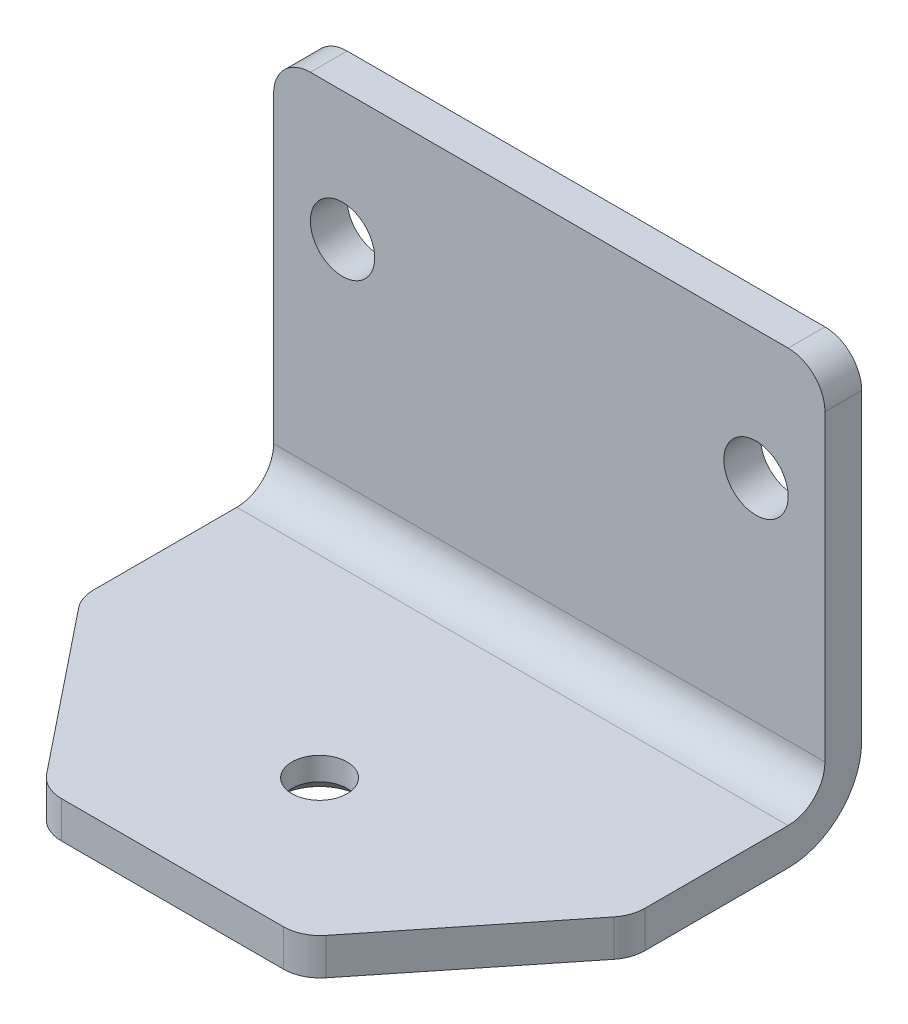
ISO-10303-21;
HEADER;
FILE_DESCRIPTION(('STEP AP214'),'2;1');
FILE_NAME('part.step','',(''),(''),'','','');
FILE_SCHEMA(('AUTOMOTIVE_DESIGN { 1 0 10303 214 1 1 1 1 }'));
ENDSEC;
DATA;
#1=APPLICATION_CONTEXT('core data for automotive mechanical design processes');
#2=APPLICATION_PROTOCOL_DEFINITION('international standard','automotive_design',2000,#1);
#3=PRODUCT_CONTEXT('',#1,'mechanical');
#4=PRODUCT('Part','Part','',(#3));
#5=PRODUCT_RELATED_PRODUCT_CATEGORY('part','',(#4));
#6=PRODUCT_DEFINITION_FORMATION('','',#4);
#7=PRODUCT_DEFINITION_CONTEXT('part definition',#1,'design');
#8=PRODUCT_DEFINITION('design','',#6,#7);
#9=PRODUCT_DEFINITION_SHAPE('','',#8);
#10=(LENGTH_UNIT() NAMED_UNIT(*) SI_UNIT(.MILLI.,.METRE.));
#11=(NAMED_UNIT(*) PLANE_ANGLE_UNIT() SI_UNIT($,.RADIAN.));
#12=(NAMED_UNIT(*) SI_UNIT($,.STERADIAN.) SOLID_ANGLE_UNIT());
#13=UNCERTAINTY_MEASURE_WITH_UNIT(LENGTH_MEASURE(1.E-05),#10,'distance_accuracy_value','');
#14=(GEOMETRIC_REPRESENTATION_CONTEXT(3) GLOBAL_UNCERTAINTY_ASSIGNED_CONTEXT((#13)) GLOBAL_UNIT_ASSIGNED_CONTEXT((#10,
#11,#12)) REPRESENTATION_CONTEXT('',''));
#15=CARTESIAN_POINT('',(0.,0.,0.));
#16=DIRECTION('',(0.,0.,1.));
#17=DIRECTION('',(1.,0.,0.));
#18=AXIS2_PLACEMENT_3D('',#15,#16,#17);
#19=CARTESIAN_POINT('',(30.,0.,0.));
#20=DIRECTION('',(0.,-1.,0.));
#21=DIRECTION('',(0.,0.,-1.));
#22=AXIS2_PLACEMENT_3D('',#19,#20,#21);
#23=PLANE('',#22);
#24=DIRECTION('',(0.,0.,1.));
#25=VECTOR('',#24,1.);
#26=CARTESIAN_POINT('',(30.,0.,0.));
#27=LINE('',#26,#25);
#28=CARTESIAN_POINT('',(30.,0.,7.99999999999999));
#29=VERTEX_POINT('',#28);
#30=CARTESIAN_POINT('',(30.,0.,23.5968757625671));
#31=VERTEX_POINT('',#30);
#32=EDGE_CURVE('E183',#29,#31,#27,.T.);
#33=ORIENTED_EDGE('',*,*,#32,.T.);
#34=CARTESIAN_POINT('',(26.,0.,23.5968757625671));
#35=DIRECTION('',(0.,-1.,0.));
#36=DIRECTION('',(0.,0.,-1.));
#37=AXIS2_PLACEMENT_3D('',#34,#35,#36);
#38=CIRCLE('',#37,4.);
#39=CARTESIAN_POINT('',(29.1234752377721,0.,26.0956559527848));
#40=VERTEX_POINT('',#39);
#41=EDGE_CURVE('E249',#31,#40,#38,.T.);
#42=ORIENTED_EDGE('',*,*,#41,.T.);
#43=DIRECTION('',(0.624695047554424,0.,-0.78086880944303));
#44=VECTOR('',#43,1.);
#45=CARTESIAN_POINT('',(42.1951219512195,0.,9.75609756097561));
#46=LINE('',#45,#44);
#47=CARTESIAN_POINT('',(15.2009758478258,0.,43.4987801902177));
#48=VERTEX_POINT('',#47);
#49=EDGE_CURVE('E234',#40,#48,#46,.F.);
#50=ORIENTED_EDGE('',*,*,#49,.T.);
#51=CARTESIAN_POINT('',(12.0775006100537,0.,41.));
#52=DIRECTION('',(0.,-1.,0.));
#53=DIRECTION('',(0.,0.,-1.));
#54=AXIS2_PLACEMENT_3D('',#51,#52,#53);
#55=CIRCLE('',#54,4.);
#56=CARTESIAN_POINT('',(12.0775006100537,0.,45.));
#57=VERTEX_POINT('',#56);
#58=EDGE_CURVE('E247',#48,#57,#55,.T.);
#59=ORIENTED_EDGE('',*,*,#58,.T.);
#60=DIRECTION('',(-1.,0.,0.));
#61=VECTOR('',#60,1.);
#62=CARTESIAN_POINT('',(30.,0.,45.));
#63=LINE('',#62,#61);
#64=CARTESIAN_POINT('',(-12.0775006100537,0.,45.));
#65=VERTEX_POINT('',#64);
#66=EDGE_CURVE('E196',#57,#65,#63,.T.);
#67=ORIENTED_EDGE('',*,*,#66,.T.);
#68=CARTESIAN_POINT('',(-12.0775006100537,0.,41.));
#69=DIRECTION('',(0.,-1.,0.));
#70=DIRECTION('',(0.,0.,-1.));
#71=AXIS2_PLACEMENT_3D('',#68,#69,#70);
#72=CIRCLE('',#71,4.);
#73=CARTESIAN_POINT('',(-15.2009758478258,0.,43.4987801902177));
#74=VERTEX_POINT('',#73);
#75=EDGE_CURVE('E245',#65,#74,#72,.T.);
#76=ORIENTED_EDGE('',*,*,#75,.T.);
#77=DIRECTION('',(-0.624695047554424,0.,-0.78086880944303));
#78=VECTOR('',#77,1.);
#79=CARTESIAN_POINT('',(-18.7804878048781,0.,39.0243902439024));
#80=LINE('',#79,#78);
#81=CARTESIAN_POINT('',(-29.1234752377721,0.,26.0956559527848));
#82=VERTEX_POINT('',#81);
#83=EDGE_CURVE('E237',#74,#82,#80,.T.);
#84=ORIENTED_EDGE('',*,*,#83,.T.);
#85=CARTESIAN_POINT('',(-26.,0.,23.5968757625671));
#86=DIRECTION('',(0.,-1.,0.));
#87=DIRECTION('',(0.,0.,-1.));
#88=AXIS2_PLACEMENT_3D('',#85,#86,#87);
#89=CIRCLE('',#88,4.);
#90=CARTESIAN_POINT('',(-30.,0.,23.5968757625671));
#91=VERTEX_POINT('',#90);
#92=EDGE_CURVE('E243',#82,#91,#89,.T.);
#93=ORIENTED_EDGE('',*,*,#92,.T.);
#94=DIRECTION('',(0.,0.,1.));
#95=VECTOR('',#94,1.);
#96=CARTESIAN_POINT('',(-30.,0.,0.));
#97=LINE('',#96,#95);
#98=CARTESIAN_POINT('',(-30.,0.,7.99999999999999));
#99=VERTEX_POINT('',#98);
#100=EDGE_CURVE('E169',#99,#91,#97,.T.);
#101=ORIENTED_EDGE('',*,*,#100,.F.);
#102=DIRECTION('',(-1.,0.,0.));
#103=VECTOR('',#102,1.);
#104=CARTESIAN_POINT('',(30.,0.,8.));
#105=LINE('',#104,#103);
#106=EDGE_CURVE('E207',#99,#29,#105,.F.);
#107=ORIENTED_EDGE('',*,*,#106,.T.);
#108=EDGE_LOOP('',(#33,#42,#50,#59,#67,#76,#84,#93,#101,#107));
#109=FACE_BOUND('',#108,.T.);
#110=CARTESIAN_POINT('',(0.,0.,29.));
#111=DIRECTION('',(0.,-1.,0.));
#112=DIRECTION('',(0.,0.,-1.));
#113=AXIS2_PLACEMENT_3D('',#110,#111,#112);
#114=CIRCLE('',#113,4.5);
#115=CARTESIAN_POINT('',(0.,0.,24.5));
#116=VERTEX_POINT('',#115);
#117=EDGE_CURVE('E366',#116,#116,#114,.T.);
#118=ORIENTED_EDGE('',*,*,#117,.F.);
#119=EDGE_LOOP('',(#118));
#120=FACE_BOUND('',#119,.T.);
#121=ADVANCED_FACE('F29',(#109,#120),#23,.T.);
#122=CARTESIAN_POINT('',(0.,0.,29.));
#123=DIRECTION('',(0.,1.,0.));
#124=DIRECTION('',(0.,0.,1.));
#125=AXIS2_PLACEMENT_3D('',#122,#123,#124);
#126=CYLINDRICAL_SURFACE('',#125,3.);
#127=CARTESIAN_POINT('',(0.,4.,29.));
#128=DIRECTION('',(0.,1.,0.));
#129=DIRECTION('',(0.,0.,1.));
#130=AXIS2_PLACEMENT_3D('',#127,#128,#129);
#131=CIRCLE('',#130,3.);
#132=CARTESIAN_POINT('',(0.,4.,32.));
#133=VERTEX_POINT('',#132);
#134=EDGE_CURVE('E358',#133,#133,#131,.T.);
#135=ORIENTED_EDGE('',*,*,#134,.T.);
#136=EDGE_LOOP('',(#135));
#137=FACE_BOUND('',#136,.T.);
#138=CARTESIAN_POINT('',(0.,1.49999999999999,29.));
#139=DIRECTION('',(0.,-1.,0.));
#140=DIRECTION('',(0.,0.,-1.));
#141=AXIS2_PLACEMENT_3D('',#138,#139,#140);
#142=CIRCLE('',#141,3.);
#143=CARTESIAN_POINT('',(0.,1.49999999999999,26.));
#144=VERTEX_POINT('',#143);
#145=EDGE_CURVE('E360',#144,#144,#142,.T.);
#146=ORIENTED_EDGE('',*,*,#145,.T.);
#147=EDGE_LOOP('',(#146));
#148=FACE_BOUND('',#147,.T.);
#149=ADVANCED_FACE('F338',(#137,#148),#126,.F.);
#150=CARTESIAN_POINT('',(30.,4.,0.));
#151=DIRECTION('',(0.,-1.,0.));
#152=DIRECTION('',(0.,0.,-1.));
#153=AXIS2_PLACEMENT_3D('',#150,#151,#152);
#154=PLANE('',#153);
#155=ORIENTED_EDGE('',*,*,#134,.F.);
#156=EDGE_LOOP('',(#155));
#157=FACE_BOUND('',#156,.T.);
#158=DIRECTION('',(-0.624695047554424,0.,0.78086880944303));
#159=VECTOR('',#158,1.);
#160=CARTESIAN_POINT('',(14.,3.99999999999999,45.));
#161=LINE('',#160,#159);
#162=CARTESIAN_POINT('',(15.2009758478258,3.99999999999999,43.4987801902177));
#163=VERTEX_POINT('',#162);
#164=CARTESIAN_POINT('',(29.1234752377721,4.,26.0956559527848));
#165=VERTEX_POINT('',#164);
#166=EDGE_CURVE('E230',#163,#165,#161,.F.);
#167=ORIENTED_EDGE('',*,*,#166,.T.);
#168=CARTESIAN_POINT('',(26.,4.,23.5968757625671));
#169=DIRECTION('',(0.,-1.,0.));
#170=DIRECTION('',(0.,0.,-1.));
#171=AXIS2_PLACEMENT_3D('',#168,#169,#170);
#172=CIRCLE('',#171,4.);
#173=CARTESIAN_POINT('',(30.,4.,23.5968757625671));
#174=VERTEX_POINT('',#173);
#175=EDGE_CURVE('E259',#165,#174,#172,.F.);
#176=ORIENTED_EDGE('',*,*,#175,.T.);
#177=DIRECTION('',(0.,0.,1.));
#178=VECTOR('',#177,1.);
#179=CARTESIAN_POINT('',(30.,4.,0.));
#180=LINE('',#179,#178);
#181=CARTESIAN_POINT('',(30.,4.,8.));
#182=VERTEX_POINT('',#181);
#183=EDGE_CURVE('E163',#182,#174,#180,.T.);
#184=ORIENTED_EDGE('',*,*,#183,.F.);
#185=DIRECTION('',(-1.,0.,0.));
#186=VECTOR('',#185,1.);
#187=CARTESIAN_POINT('',(-30.,4.,8.));
#188=LINE('',#187,#186);
#189=CARTESIAN_POINT('',(-30.,4.,8.));
#190=VERTEX_POINT('',#189);
#191=EDGE_CURVE('E150',#182,#190,#188,.T.);
#192=ORIENTED_EDGE('',*,*,#191,.T.);
#193=DIRECTION('',(0.,0.,1.));
#194=VECTOR('',#193,1.);
#195=CARTESIAN_POINT('',(-30.,4.,0.));
#196=LINE('',#195,#194);
#197=CARTESIAN_POINT('',(-30.,4.,23.5968757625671));
#198=VERTEX_POINT('',#197);
#199=EDGE_CURVE('E161',#190,#198,#196,.T.);
#200=ORIENTED_EDGE('',*,*,#199,.T.);
#201=CARTESIAN_POINT('',(-26.,4.,23.5968757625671));
#202=DIRECTION('',(0.,-1.,0.));
#203=DIRECTION('',(0.,0.,-1.));
#204=AXIS2_PLACEMENT_3D('',#201,#202,#203);
#205=CIRCLE('',#204,4.);
#206=CARTESIAN_POINT('',(-29.1234752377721,4.,26.0956559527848));
#207=VERTEX_POINT('',#206);
#208=EDGE_CURVE('E255',#198,#207,#205,.F.);
#209=ORIENTED_EDGE('',*,*,#208,.T.);
#210=DIRECTION('',(0.624695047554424,0.,0.78086880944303));
#211=VECTOR('',#210,1.);
#212=CARTESIAN_POINT('',(-30.,4.,25.));
#213=LINE('',#212,#211);
#214=CARTESIAN_POINT('',(-15.2009758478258,3.99999999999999,43.4987801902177));
#215=VERTEX_POINT('',#214);
#216=EDGE_CURVE('E232',#207,#215,#213,.T.);
#217=ORIENTED_EDGE('',*,*,#216,.T.);
#218=CARTESIAN_POINT('',(-12.0775006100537,3.99999999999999,41.));
#219=DIRECTION('',(0.,-1.,0.));
#220=DIRECTION('',(0.,0.,-1.));
#221=AXIS2_PLACEMENT_3D('',#218,#219,#220);
#222=CIRCLE('',#221,4.);
#223=CARTESIAN_POINT('',(-12.0775006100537,3.99999999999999,45.));
#224=VERTEX_POINT('',#223);
#225=EDGE_CURVE('E44',#215,#224,#222,.F.);
#226=ORIENTED_EDGE('',*,*,#225,.T.);
#227=DIRECTION('',(-1.,0.,0.));
#228=VECTOR('',#227,1.);
#229=CARTESIAN_POINT('',(30.,3.99999999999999,45.));
#230=LINE('',#229,#228);
#231=CARTESIAN_POINT('',(12.0775006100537,3.99999999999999,45.));
#232=VERTEX_POINT('',#231);
#233=EDGE_CURVE('E164',#232,#224,#230,.T.);
#234=ORIENTED_EDGE('',*,*,#233,.F.);
#235=CARTESIAN_POINT('',(12.0775006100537,3.99999999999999,41.));
#236=DIRECTION('',(0.,-1.,0.));
#237=DIRECTION('',(0.,0.,-1.));
#238=AXIS2_PLACEMENT_3D('',#235,#236,#237);
#239=CIRCLE('',#238,4.);
#240=EDGE_CURVE('E52',#232,#163,#239,.F.);
#241=ORIENTED_EDGE('',*,*,#240,.T.);
#242=EDGE_LOOP('',(#167,#176,#184,#192,#200,#209,#217,#226,#234,#241));
#243=FACE_BOUND('',#242,.T.);
#244=ADVANCED_FACE('F31',(#157,#243),#154,.F.);
#245=CARTESIAN_POINT('',(30.,0.,45.));
#246=DIRECTION('',(0.,0.,1.));
#247=DIRECTION('',(1.,0.,0.));
#248=AXIS2_PLACEMENT_3D('',#245,#246,#247);
#249=PLANE('',#248);
#250=ORIENTED_EDGE('',*,*,#66,.F.);
#251=DIRECTION('',(0.,-1.,0.));
#252=VECTOR('',#251,1.);
#253=CARTESIAN_POINT('',(12.0775006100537,0.,45.));
#254=LINE('',#253,#252);
#255=EDGE_CURVE('E264',#57,#232,#254,.F.);
#256=ORIENTED_EDGE('',*,*,#255,.T.);
#257=ORIENTED_EDGE('',*,*,#233,.T.);
#258=DIRECTION('',(0.,-1.,0.));
#259=VECTOR('',#258,1.);
#260=CARTESIAN_POINT('',(-12.0775006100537,0.,45.));
#261=LINE('',#260,#259);
#262=EDGE_CURVE('E261',#224,#65,#261,.T.);
#263=ORIENTED_EDGE('',*,*,#262,.T.);
#264=EDGE_LOOP('',(#250,#256,#257,#263));
#265=FACE_BOUND('',#264,.T.);
#266=ADVANCED_FACE('F278',(#265),#249,.T.);
#267=CARTESIAN_POINT('',(30.,0.,0.));
#268=DIRECTION('',(0.,0.,-1.));
#269=DIRECTION('',(-1.,0.,0.));
#270=AXIS2_PLACEMENT_3D('',#267,#268,#269);
#271=PLANE('',#270);
#272=CARTESIAN_POINT('',(22.5,31.,0.));
#273=DIRECTION('',(0.,0.,1.));
#274=DIRECTION('',(1.,0.,0.));
#275=AXIS2_PLACEMENT_3D('',#272,#273,#274);
#276=CIRCLE('',#275,3.5);
#277=CARTESIAN_POINT('',(26.,31.,0.));
#278=VERTEX_POINT('',#277);
#279=EDGE_CURVE('E359',#278,#278,#276,.T.);
#280=ORIENTED_EDGE('',*,*,#279,.T.);
#281=EDGE_LOOP('',(#280));
#282=FACE_BOUND('',#281,.T.);
#283=CARTESIAN_POINT('',(-22.5,31.,0.));
#284=DIRECTION('',(0.,0.,1.));
#285=DIRECTION('',(1.,0.,0.));
#286=AXIS2_PLACEMENT_3D('',#283,#284,#285);
#287=CIRCLE('',#286,3.5);
#288=CARTESIAN_POINT('',(-19.,31.,0.));
#289=VERTEX_POINT('',#288);
#290=EDGE_CURVE('E170',#289,#289,#287,.T.);
#291=ORIENTED_EDGE('',*,*,#290,.T.);
#292=EDGE_LOOP('',(#291));
#293=FACE_BOUND('',#292,.T.);
#294=DIRECTION('',(-1.,0.,0.));
#295=VECTOR('',#294,1.);
#296=CARTESIAN_POINT('',(30.,45.,0.));
#297=LINE('',#296,#295);
#298=CARTESIAN_POINT('',(26.,45.,0.));
#299=VERTEX_POINT('',#298);
#300=CARTESIAN_POINT('',(-26.,45.,0.));
#301=VERTEX_POINT('',#300);
#302=EDGE_CURVE('E193',#299,#301,#297,.T.);
#303=ORIENTED_EDGE('',*,*,#302,.F.);
#304=CARTESIAN_POINT('',(26.,41.,0.));
#305=DIRECTION('',(0.,0.,-1.));
#306=DIRECTION('',(-1.,0.,0.));
#307=AXIS2_PLACEMENT_3D('',#304,#305,#306);
#308=CIRCLE('',#307,4.);
#309=CARTESIAN_POINT('',(30.,41.,0.));
#310=VERTEX_POINT('',#309);
#311=EDGE_CURVE('E219',#299,#310,#308,.T.);
#312=ORIENTED_EDGE('',*,*,#311,.T.);
#313=DIRECTION('',(0.,-1.,0.));
#314=VECTOR('',#313,1.);
#315=CARTESIAN_POINT('',(30.,0.,0.));
#316=LINE('',#315,#314);
#317=CARTESIAN_POINT('',(30.,7.99999999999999,0.));
#318=VERTEX_POINT('',#317);
#319=EDGE_CURVE('E186',#310,#318,#316,.T.);
#320=ORIENTED_EDGE('',*,*,#319,.T.);
#321=DIRECTION('',(-1.,0.,0.));
#322=VECTOR('',#321,1.);
#323=CARTESIAN_POINT('',(30.,7.99999999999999,0.));
#324=LINE('',#323,#322);
#325=CARTESIAN_POINT('',(-30.,7.99999999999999,0.));
#326=VERTEX_POINT('',#325);
#327=EDGE_CURVE('E202',#318,#326,#324,.T.);
#328=ORIENTED_EDGE('',*,*,#327,.T.);
#329=DIRECTION('',(0.,-1.,0.));
#330=VECTOR('',#329,1.);
#331=CARTESIAN_POINT('',(-30.,0.,0.));
#332=LINE('',#331,#330);
#333=CARTESIAN_POINT('',(-30.,41.,0.));
#334=VERTEX_POINT('',#333);
#335=EDGE_CURVE('E172',#334,#326,#332,.T.);
#336=ORIENTED_EDGE('',*,*,#335,.F.);
#337=CARTESIAN_POINT('',(-26.,41.,0.));
#338=DIRECTION('',(0.,0.,-1.));
#339=DIRECTION('',(-1.,0.,0.));
#340=AXIS2_PLACEMENT_3D('',#337,#338,#339);
#341=CIRCLE('',#340,4.);
#342=EDGE_CURVE('E217',#334,#301,#341,.T.);
#343=ORIENTED_EDGE('',*,*,#342,.T.);
#344=EDGE_LOOP('',(#303,#312,#320,#328,#336,#343));
#345=FACE_BOUND('',#344,.T.);
#346=ADVANCED_FACE('F309',(#282,#293,#345),#271,.T.);
#347=CARTESIAN_POINT('',(30.,45.,4.));
#348=DIRECTION('',(0.,1.,0.));
#349=DIRECTION('',(0.,0.,1.));
#350=AXIS2_PLACEMENT_3D('',#347,#348,#349);
#351=PLANE('',#350);
#352=DIRECTION('',(-1.,0.,0.));
#353=VECTOR('',#352,1.);
#354=CARTESIAN_POINT('',(30.,45.,4.));
#355=LINE('',#354,#353);
#356=CARTESIAN_POINT('',(26.,45.,4.));
#357=VERTEX_POINT('',#356);
#358=CARTESIAN_POINT('',(-26.,45.,4.));
#359=VERTEX_POINT('',#358);
#360=EDGE_CURVE('E190',#357,#359,#355,.T.);
#361=ORIENTED_EDGE('',*,*,#360,.F.);
#362=DIRECTION('',(0.,0.,-1.));
#363=VECTOR('',#362,1.);
#364=CARTESIAN_POINT('',(26.,45.,4.));
#365=LINE('',#364,#363);
#366=EDGE_CURVE('E214',#357,#299,#365,.T.);
#367=ORIENTED_EDGE('',*,*,#366,.T.);
#368=ORIENTED_EDGE('',*,*,#302,.T.);
#369=DIRECTION('',(0.,0.,-1.));
#370=VECTOR('',#369,1.);
#371=CARTESIAN_POINT('',(-26.,45.,4.));
#372=LINE('',#371,#370);
#373=EDGE_CURVE('E212',#301,#359,#372,.F.);
#374=ORIENTED_EDGE('',*,*,#373,.T.);
#375=EDGE_LOOP('',(#361,#367,#368,#374));
#376=FACE_BOUND('',#375,.T.);
#377=ADVANCED_FACE('F312',(#376),#351,.T.);
#378=CARTESIAN_POINT('',(30.,0.,4.));
#379=DIRECTION('',(0.,0.,-1.));
#380=DIRECTION('',(-1.,0.,0.));
#381=AXIS2_PLACEMENT_3D('',#378,#379,#380);
#382=PLANE('',#381);
#383=CARTESIAN_POINT('',(22.5,31.,4.));
#384=DIRECTION('',(0.,0.,1.));
#385=DIRECTION('',(1.,0.,0.));
#386=AXIS2_PLACEMENT_3D('',#383,#384,#385);
#387=CIRCLE('',#386,3.5);
#388=CARTESIAN_POINT('',(26.,31.,4.));
#389=VERTEX_POINT('',#388);
#390=EDGE_CURVE('E363',#389,#389,#387,.T.);
#391=ORIENTED_EDGE('',*,*,#390,.F.);
#392=EDGE_LOOP('',(#391));
#393=FACE_BOUND('',#392,.T.);
#394=CARTESIAN_POINT('',(-22.5,31.,4.));
#395=DIRECTION('',(0.,0.,1.));
#396=DIRECTION('',(1.,0.,0.));
#397=AXIS2_PLACEMENT_3D('',#394,#395,#396);
#398=CIRCLE('',#397,3.5);
#399=CARTESIAN_POINT('',(-19.,31.,4.));
#400=VERTEX_POINT('',#399);
#401=EDGE_CURVE('E175',#400,#400,#398,.T.);
#402=ORIENTED_EDGE('',*,*,#401,.F.);
#403=EDGE_LOOP('',(#402));
#404=FACE_BOUND('',#403,.T.);
#405=DIRECTION('',(0.,1.,0.));
#406=VECTOR('',#405,1.);
#407=CARTESIAN_POINT('',(30.,0.,4.));
#408=LINE('',#407,#406);
#409=CARTESIAN_POINT('',(30.,41.,4.));
#410=VERTEX_POINT('',#409);
#411=CARTESIAN_POINT('',(30.,8.,4.));
#412=VERTEX_POINT('',#411);
#413=EDGE_CURVE('E188',#410,#412,#408,.F.);
#414=ORIENTED_EDGE('',*,*,#413,.F.);
#415=CARTESIAN_POINT('',(26.,41.,4.));
#416=DIRECTION('',(0.,0.,-1.));
#417=DIRECTION('',(-1.,0.,0.));
#418=AXIS2_PLACEMENT_3D('',#415,#416,#417);
#419=CIRCLE('',#418,4.);
#420=EDGE_CURVE('E225',#410,#357,#419,.F.);
#421=ORIENTED_EDGE('',*,*,#420,.T.);
#422=ORIENTED_EDGE('',*,*,#360,.T.);
#423=CARTESIAN_POINT('',(-26.,41.,4.));
#424=DIRECTION('',(0.,0.,-1.));
#425=DIRECTION('',(-1.,0.,0.));
#426=AXIS2_PLACEMENT_3D('',#423,#424,#425);
#427=CIRCLE('',#426,4.);
#428=CARTESIAN_POINT('',(-30.,41.,4.));
#429=VERTEX_POINT('',#428);
#430=EDGE_CURVE('E223',#359,#429,#427,.F.);
#431=ORIENTED_EDGE('',*,*,#430,.T.);
#432=DIRECTION('',(0.,1.,0.));
#433=VECTOR('',#432,1.);
#434=CARTESIAN_POINT('',(-30.,0.,4.));
#435=LINE('',#434,#433);
#436=CARTESIAN_POINT('',(-30.,8.,4.));
#437=VERTEX_POINT('',#436);
#438=EDGE_CURVE('E180',#429,#437,#435,.F.);
#439=ORIENTED_EDGE('',*,*,#438,.T.);
#440=DIRECTION('',(-1.,0.,0.));
#441=VECTOR('',#440,1.);
#442=CARTESIAN_POINT('',(30.,8.,4.));
#443=LINE('',#442,#441);
#444=EDGE_CURVE('E152',#437,#412,#443,.F.);
#445=ORIENTED_EDGE('',*,*,#444,.T.);
#446=EDGE_LOOP('',(#414,#421,#422,#431,#439,#445));
#447=FACE_BOUND('',#446,.T.);
#448=ADVANCED_FACE('F300',(#393,#404,#447),#382,.F.);
#449=CARTESIAN_POINT('',(30.,4.,0.));
#450=DIRECTION('',(1.,0.,0.));
#451=DIRECTION('',(0.,0.,-1.));
#452=AXIS2_PLACEMENT_3D('',#449,#450,#451);
#453=PLANE('',#452);
#454=ORIENTED_EDGE('',*,*,#183,.T.);
#455=DIRECTION('',(0.,1.,0.));
#456=VECTOR('',#455,1.);
#457=CARTESIAN_POINT('',(30.,4.,23.5968757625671));
#458=LINE('',#457,#456);
#459=EDGE_CURVE('E240',#174,#31,#458,.F.);
#460=ORIENTED_EDGE('',*,*,#459,.T.);
#461=ORIENTED_EDGE('',*,*,#32,.F.);
#462=CARTESIAN_POINT('',(30.,7.99999999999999,8.));
#463=DIRECTION('',(1.,0.,0.));
#464=DIRECTION('',(0.,0.,-1.));
#465=AXIS2_PLACEMENT_3D('',#462,#463,#464);
#466=CIRCLE('',#465,8.);
#467=EDGE_CURVE('E209',#29,#318,#466,.T.);
#468=ORIENTED_EDGE('',*,*,#467,.T.);
#469=ORIENTED_EDGE('',*,*,#319,.F.);
#470=DIRECTION('',(0.,0.,-1.));
#471=VECTOR('',#470,1.);
#472=CARTESIAN_POINT('',(30.,41.,0.));
#473=LINE('',#472,#471);
#474=EDGE_CURVE('E221',#310,#410,#473,.F.);
#475=ORIENTED_EDGE('',*,*,#474,.T.);
#476=ORIENTED_EDGE('',*,*,#413,.T.);
#477=CARTESIAN_POINT('',(30.,8.,8.));
#478=DIRECTION('',(1.,0.,0.));
#479=DIRECTION('',(0.,0.,-1.));
#480=AXIS2_PLACEMENT_3D('',#477,#478,#479);
#481=CIRCLE('',#480,4.);
#482=EDGE_CURVE('E156',#412,#182,#481,.F.);
#483=ORIENTED_EDGE('',*,*,#482,.T.);
#484=EDGE_LOOP('',(#454,#460,#461,#468,#469,#475,#476,#483));
#485=FACE_BOUND('',#484,.T.);
#486=ADVANCED_FACE('F293',(#485),#453,.T.);
#487=CARTESIAN_POINT('',(-30.,4.,0.));
#488=DIRECTION('',(1.,0.,0.));
#489=DIRECTION('',(0.,0.,-1.));
#490=AXIS2_PLACEMENT_3D('',#487,#488,#489);
#491=PLANE('',#490);
#492=ORIENTED_EDGE('',*,*,#100,.T.);
#493=DIRECTION('',(0.,1.,0.));
#494=VECTOR('',#493,1.);
#495=CARTESIAN_POINT('',(-30.,4.,23.5968757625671));
#496=LINE('',#495,#494);
#497=EDGE_CURVE('E11',#91,#198,#496,.T.);
#498=ORIENTED_EDGE('',*,*,#497,.T.);
#499=ORIENTED_EDGE('',*,*,#199,.F.);
#500=CARTESIAN_POINT('',(-30.,8.,8.));
#501=DIRECTION('',(1.,0.,0.));
#502=DIRECTION('',(0.,0.,-1.));
#503=AXIS2_PLACEMENT_3D('',#500,#501,#502);
#504=CIRCLE('',#503,4.);
#505=EDGE_CURVE('E146',#190,#437,#504,.T.);
#506=ORIENTED_EDGE('',*,*,#505,.T.);
#507=ORIENTED_EDGE('',*,*,#438,.F.);
#508=DIRECTION('',(0.,0.,-1.));
#509=VECTOR('',#508,1.);
#510=CARTESIAN_POINT('',(-30.,41.,0.));
#511=LINE('',#510,#509);
#512=EDGE_CURVE('E227',#429,#334,#511,.T.);
#513=ORIENTED_EDGE('',*,*,#512,.T.);
#514=ORIENTED_EDGE('',*,*,#335,.T.);
#515=CARTESIAN_POINT('',(-30.,7.99999999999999,8.));
#516=DIRECTION('',(1.,0.,0.));
#517=DIRECTION('',(0.,0.,-1.));
#518=AXIS2_PLACEMENT_3D('',#515,#516,#517);
#519=CIRCLE('',#518,8.);
#520=EDGE_CURVE('E205',#326,#99,#519,.F.);
#521=ORIENTED_EDGE('',*,*,#520,.T.);
#522=EDGE_LOOP('',(#492,#498,#499,#506,#507,#513,#514,#521));
#523=FACE_BOUND('',#522,.T.);
#524=ADVANCED_FACE('F167',(#523),#491,.F.);
#525=CARTESIAN_POINT('',(30.,8.,8.));
#526=DIRECTION('',(1.,0.,0.));
#527=DIRECTION('',(0.,0.,-1.));
#528=AXIS2_PLACEMENT_3D('',#525,#526,#527);
#529=CYLINDRICAL_SURFACE('',#528,4.);
#530=ORIENTED_EDGE('',*,*,#482,.F.);
#531=ORIENTED_EDGE('',*,*,#444,.F.);
#532=ORIENTED_EDGE('',*,*,#505,.F.);
#533=ORIENTED_EDGE('',*,*,#191,.F.);
#534=EDGE_LOOP('',(#530,#531,#532,#533));
#535=FACE_BOUND('',#534,.T.);
#536=ADVANCED_FACE('F149',(#535),#529,.F.);
#537=CARTESIAN_POINT('',(30.,7.99999999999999,8.));
#538=DIRECTION('',(-1.,0.,0.));
#539=DIRECTION('',(0.,0.,1.));
#540=AXIS2_PLACEMENT_3D('',#537,#538,#539);
#541=CYLINDRICAL_SURFACE('',#540,8.);
#542=ORIENTED_EDGE('',*,*,#467,.F.);
#543=ORIENTED_EDGE('',*,*,#106,.F.);
#544=ORIENTED_EDGE('',*,*,#520,.F.);
#545=ORIENTED_EDGE('',*,*,#327,.F.);
#546=EDGE_LOOP('',(#542,#543,#544,#545));
#547=FACE_BOUND('',#546,.T.);
#548=ADVANCED_FACE('F321',(#547),#541,.T.);
#549=CARTESIAN_POINT('',(26.,41.,4.));
#550=DIRECTION('',(0.,0.,-1.));
#551=DIRECTION('',(-1.,0.,0.));
#552=AXIS2_PLACEMENT_3D('',#549,#550,#551);
#553=CYLINDRICAL_SURFACE('',#552,4.);
#554=ORIENTED_EDGE('',*,*,#420,.F.);
#555=ORIENTED_EDGE('',*,*,#474,.F.);
#556=ORIENTED_EDGE('',*,*,#311,.F.);
#557=ORIENTED_EDGE('',*,*,#366,.F.);
#558=EDGE_LOOP('',(#554,#555,#556,#557));
#559=FACE_BOUND('',#558,.T.);
#560=ADVANCED_FACE('F315',(#559),#553,.T.);
#561=CARTESIAN_POINT('',(-26.,41.,0.));
#562=DIRECTION('',(0.,0.,1.));
#563=DIRECTION('',(1.,0.,0.));
#564=AXIS2_PLACEMENT_3D('',#561,#562,#563);
#565=CYLINDRICAL_SURFACE('',#564,4.);
#566=ORIENTED_EDGE('',*,*,#430,.F.);
#567=ORIENTED_EDGE('',*,*,#373,.F.);
#568=ORIENTED_EDGE('',*,*,#342,.F.);
#569=ORIENTED_EDGE('',*,*,#512,.F.);
#570=EDGE_LOOP('',(#566,#567,#568,#569));
#571=FACE_BOUND('',#570,.T.);
#572=ADVANCED_FACE('F305',(#571),#565,.T.);
#573=CARTESIAN_POINT('',(-30.,4.,25.));
#574=DIRECTION('',(-0.78086880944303,0.,0.624695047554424));
#575=DIRECTION('',(0.624695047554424,0.,0.78086880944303));
#576=AXIS2_PLACEMENT_3D('',#573,#574,#575);
#577=PLANE('',#576);
#578=ORIENTED_EDGE('',*,*,#83,.F.);
#579=DIRECTION('',(0.,-1.,0.));
#580=VECTOR('',#579,1.);
#581=CARTESIAN_POINT('',(-15.2009758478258,4.,43.4987801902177));
#582=LINE('',#581,#580);
#583=EDGE_CURVE('E37',#74,#215,#582,.F.);
#584=ORIENTED_EDGE('',*,*,#583,.T.);
#585=ORIENTED_EDGE('',*,*,#216,.F.);
#586=DIRECTION('',(0.,1.,0.));
#587=VECTOR('',#586,1.);
#588=CARTESIAN_POINT('',(-29.1234752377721,0.,26.0956559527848));
#589=LINE('',#588,#587);
#590=EDGE_CURVE('E266',#207,#82,#589,.F.);
#591=ORIENTED_EDGE('',*,*,#590,.T.);
#592=EDGE_LOOP('',(#578,#584,#585,#591));
#593=FACE_BOUND('',#592,.T.);
#594=ADVANCED_FACE('F271',(#593),#577,.T.);
#595=CARTESIAN_POINT('',(14.,0.,45.));
#596=DIRECTION('',(-0.78086880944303,0.,-0.624695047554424));
#597=DIRECTION('',(-0.624695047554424,0.,0.78086880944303));
#598=AXIS2_PLACEMENT_3D('',#595,#596,#597);
#599=PLANE('',#598);
#600=ORIENTED_EDGE('',*,*,#49,.F.);
#601=DIRECTION('',(0.,-1.,0.));
#602=VECTOR('',#601,1.);
#603=CARTESIAN_POINT('',(29.1234752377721,0.,26.0956559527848));
#604=LINE('',#603,#602);
#605=EDGE_CURVE('E253',#40,#165,#604,.F.);
#606=ORIENTED_EDGE('',*,*,#605,.T.);
#607=ORIENTED_EDGE('',*,*,#166,.F.);
#608=DIRECTION('',(0.,1.,0.));
#609=VECTOR('',#608,1.);
#610=CARTESIAN_POINT('',(15.2009758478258,0.,43.4987801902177));
#611=LINE('',#610,#609);
#612=EDGE_CURVE('E251',#163,#48,#611,.F.);
#613=ORIENTED_EDGE('',*,*,#612,.T.);
#614=EDGE_LOOP('',(#600,#606,#607,#613));
#615=FACE_BOUND('',#614,.T.);
#616=ADVANCED_FACE('F287',(#615),#599,.F.);
#617=CARTESIAN_POINT('',(26.,4.,23.5968757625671));
#618=DIRECTION('',(0.,1.,0.));
#619=DIRECTION('',(0.,0.,1.));
#620=AXIS2_PLACEMENT_3D('',#617,#618,#619);
#621=CYLINDRICAL_SURFACE('',#620,4.);
#622=ORIENTED_EDGE('',*,*,#175,.F.);
#623=ORIENTED_EDGE('',*,*,#605,.F.);
#624=ORIENTED_EDGE('',*,*,#41,.F.);
#625=ORIENTED_EDGE('',*,*,#459,.F.);
#626=EDGE_LOOP('',(#622,#623,#624,#625));
#627=FACE_BOUND('',#626,.T.);
#628=ADVANCED_FACE('F290',(#627),#621,.T.);
#629=CARTESIAN_POINT('',(12.0775006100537,0.,41.));
#630=DIRECTION('',(0.,-1.,0.));
#631=DIRECTION('',(0.,0.,-1.));
#632=AXIS2_PLACEMENT_3D('',#629,#630,#631);
#633=CYLINDRICAL_SURFACE('',#632,4.);
#634=ORIENTED_EDGE('',*,*,#58,.F.);
#635=ORIENTED_EDGE('',*,*,#612,.F.);
#636=ORIENTED_EDGE('',*,*,#240,.F.);
#637=ORIENTED_EDGE('',*,*,#255,.F.);
#638=EDGE_LOOP('',(#634,#635,#636,#637));
#639=FACE_BOUND('',#638,.T.);
#640=ADVANCED_FACE('F283',(#639),#633,.T.);
#641=CARTESIAN_POINT('',(-12.0775006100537,0.,41.));
#642=DIRECTION('',(0.,-1.,0.));
#643=DIRECTION('',(0.,0.,-1.));
#644=AXIS2_PLACEMENT_3D('',#641,#642,#643);
#645=CYLINDRICAL_SURFACE('',#644,4.);
#646=ORIENTED_EDGE('',*,*,#225,.F.);
#647=ORIENTED_EDGE('',*,*,#583,.F.);
#648=ORIENTED_EDGE('',*,*,#75,.F.);
#649=ORIENTED_EDGE('',*,*,#262,.F.);
#650=EDGE_LOOP('',(#646,#647,#648,#649));
#651=FACE_BOUND('',#650,.T.);
#652=ADVANCED_FACE('F275',(#651),#645,.T.);
#653=CARTESIAN_POINT('',(-26.,4.,23.5968757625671));
#654=DIRECTION('',(0.,-1.,0.));
#655=DIRECTION('',(0.,0.,-1.));
#656=AXIS2_PLACEMENT_3D('',#653,#654,#655);
#657=CYLINDRICAL_SURFACE('',#656,4.);
#658=ORIENTED_EDGE('',*,*,#92,.F.);
#659=ORIENTED_EDGE('',*,*,#590,.F.);
#660=ORIENTED_EDGE('',*,*,#208,.F.);
#661=ORIENTED_EDGE('',*,*,#497,.F.);
#662=EDGE_LOOP('',(#658,#659,#660,#661));
#663=FACE_BOUND('',#662,.T.);
#664=ADVANCED_FACE('F325',(#663),#657,.T.);
#665=CARTESIAN_POINT('',(-22.5,31.,0.));
#666=DIRECTION('',(0.,0.,1.));
#667=DIRECTION('',(1.,0.,0.));
#668=AXIS2_PLACEMENT_3D('',#665,#666,#667);
#669=CYLINDRICAL_SURFACE('',#668,3.5);
#670=ORIENTED_EDGE('',*,*,#290,.F.);
#671=EDGE_LOOP('',(#670));
#672=FACE_BOUND('',#671,.T.);
#673=ORIENTED_EDGE('',*,*,#401,.T.);
#674=EDGE_LOOP('',(#673));
#675=FACE_BOUND('',#674,.T.);
#676=ADVANCED_FACE('F327',(#672,#675),#669,.F.);
#677=CARTESIAN_POINT('',(22.5,31.,0.));
#678=DIRECTION('',(0.,0.,1.));
#679=DIRECTION('',(1.,0.,0.));
#680=AXIS2_PLACEMENT_3D('',#677,#678,#679);
#681=CYLINDRICAL_SURFACE('',#680,3.5);
#682=ORIENTED_EDGE('',*,*,#279,.F.);
#683=EDGE_LOOP('',(#682));
#684=FACE_BOUND('',#683,.T.);
#685=ORIENTED_EDGE('',*,*,#390,.T.);
#686=EDGE_LOOP('',(#685));
#687=FACE_BOUND('',#686,.T.);
#688=ADVANCED_FACE('F333',(#684,#687),#681,.F.);
#689=CARTESIAN_POINT('',(0.,1.49999999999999,29.));
#690=DIRECTION('',(0.,-1.,0.));
#691=DIRECTION('',(0.,0.,-1.));
#692=AXIS2_PLACEMENT_3D('',#689,#690,#691);
#693=CONICAL_SURFACE('',#692,3.,0.785398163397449);
#694=ORIENTED_EDGE('',*,*,#117,.T.);
#695=EDGE_LOOP('',(#694));
#696=FACE_BOUND('',#695,.T.);
#697=ORIENTED_EDGE('',*,*,#145,.F.);
#698=EDGE_LOOP('',(#697));
#699=FACE_BOUND('',#698,.T.);
#700=ADVANCED_FACE('F441',(#696,#699),#693,.F.);
#701=CLOSED_SHELL('',(#121,#149,#244,#266,#346,#377,#448,#486,#524,#536,#548,#560,#572,#594,
#616,#628,#640,#652,#664,#676,#688,#700));
#702=MANIFOLD_SOLID_BREP('B2',#701);
#703=ADVANCED_BREP_SHAPE_REPRESENTATION('',(#18,#702),#14);
#704=SHAPE_DEFINITION_REPRESENTATION(#9,#703);
ENDSEC;
END-ISO-10303-21;
